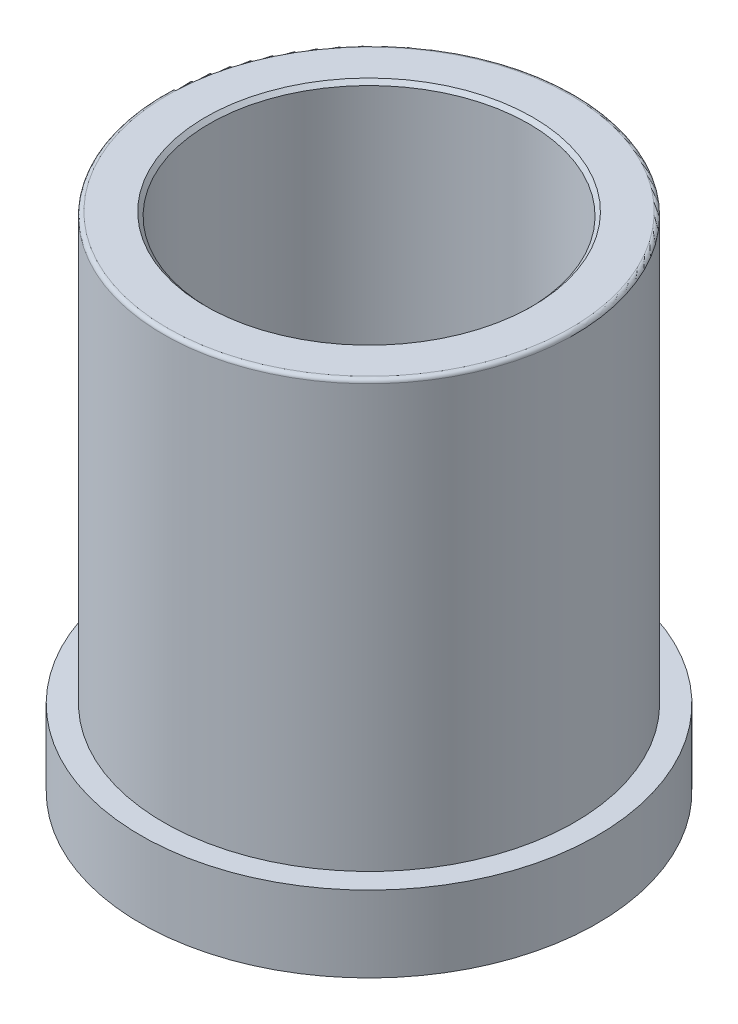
ISO-10303-21;
HEADER;
FILE_DESCRIPTION(('STEP AP214'),'2;1');
FILE_NAME('part.step','',(''),(''),'','','');
FILE_SCHEMA(('AUTOMOTIVE_DESIGN { 1 0 10303 214 1 1 1 1 }'));
ENDSEC;
DATA;
#1=APPLICATION_CONTEXT('core data for automotive mechanical design processes');
#2=APPLICATION_PROTOCOL_DEFINITION('international standard','automotive_design',2000,#1);
#3=PRODUCT_CONTEXT('',#1,'mechanical');
#4=PRODUCT('Part','Part','',(#3));
#5=PRODUCT_RELATED_PRODUCT_CATEGORY('part','',(#4));
#6=PRODUCT_DEFINITION_FORMATION('','',#4);
#7=PRODUCT_DEFINITION_CONTEXT('part definition',#1,'design');
#8=PRODUCT_DEFINITION('design','',#6,#7);
#9=PRODUCT_DEFINITION_SHAPE('','',#8);
#10=(LENGTH_UNIT() NAMED_UNIT(*) SI_UNIT(.MILLI.,.METRE.));
#11=(NAMED_UNIT(*) PLANE_ANGLE_UNIT() SI_UNIT($,.RADIAN.));
#12=(NAMED_UNIT(*) SI_UNIT($,.STERADIAN.) SOLID_ANGLE_UNIT());
#13=UNCERTAINTY_MEASURE_WITH_UNIT(LENGTH_MEASURE(1.E-05),#10,'distance_accuracy_value','');
#14=(GEOMETRIC_REPRESENTATION_CONTEXT(3) GLOBAL_UNCERTAINTY_ASSIGNED_CONTEXT((#13)) GLOBAL_UNIT_ASSIGNED_CONTEXT((#10,
#11,#12)) REPRESENTATION_CONTEXT('',''));
#15=CARTESIAN_POINT('',(0.,0.,0.));
#16=DIRECTION('',(0.,0.,1.));
#17=DIRECTION('',(1.,0.,0.));
#18=AXIS2_PLACEMENT_3D('',#15,#16,#17);
#19=CARTESIAN_POINT('',(0.,0.,0.));
#20=DIRECTION('',(0.,-1.,0.));
#21=DIRECTION('',(0.,0.,-1.));
#22=AXIS2_PLACEMENT_3D('',#19,#20,#21);
#23=CYLINDRICAL_SURFACE('',#22,27.);
#24=CARTESIAN_POINT('',(0.,55.5,0.));
#25=DIRECTION('',(0.,-1.,0.));
#26=DIRECTION('',(0.,0.,-1.));
#27=AXIS2_PLACEMENT_3D('',#24,#25,#26);
#28=CIRCLE('',#27,27.);
#29=CARTESIAN_POINT('',(0.,55.5,-27.));
#30=VERTEX_POINT('',#29);
#31=EDGE_CURVE('E21',#30,#30,#28,.T.);
#32=ORIENTED_EDGE('',*,*,#31,.T.);
#33=EDGE_LOOP('',(#32));
#34=FACE_BOUND('',#33,.T.);
#35=CARTESIAN_POINT('',(0.,0.,0.));
#36=DIRECTION('',(0.,-1.,0.));
#37=DIRECTION('',(0.,0.,-1.));
#38=AXIS2_PLACEMENT_3D('',#35,#36,#37);
#39=CIRCLE('',#38,27.);
#40=CARTESIAN_POINT('',(0.,0.,-27.));
#41=VERTEX_POINT('',#40);
#42=EDGE_CURVE('E49',#41,#41,#39,.T.);
#43=ORIENTED_EDGE('',*,*,#42,.F.);
#44=EDGE_LOOP('',(#43));
#45=FACE_BOUND('',#44,.T.);
#46=ADVANCED_FACE('F14',(#34,#45),#23,.T.);
#47=CARTESIAN_POINT('',(-27.,56.,0.));
#48=DIRECTION('',(0.,-1.,0.));
#49=DIRECTION('',(0.,0.,-1.));
#50=AXIS2_PLACEMENT_3D('',#47,#48,#49);
#51=PLANE('',#50);
#52=CARTESIAN_POINT('',(0.,56.,0.));
#53=DIRECTION('',(0.,-1.,0.));
#54=DIRECTION('',(0.,0.,-1.));
#55=AXIS2_PLACEMENT_3D('',#52,#53,#54);
#56=CIRCLE('',#55,26.5);
#57=CARTESIAN_POINT('',(0.,56.,-26.5));
#58=VERTEX_POINT('',#57);
#59=EDGE_CURVE('E9',#58,#58,#56,.F.);
#60=ORIENTED_EDGE('',*,*,#59,.T.);
#61=EDGE_LOOP('',(#60));
#62=FACE_BOUND('',#61,.T.);
#63=CARTESIAN_POINT('',(0.,56.,0.));
#64=DIRECTION('',(0.,-1.,0.));
#65=DIRECTION('',(0.,0.,-1.));
#66=AXIS2_PLACEMENT_3D('',#63,#64,#65);
#67=CIRCLE('',#66,21.5);
#68=CARTESIAN_POINT('',(0.,56.,-21.5));
#69=VERTEX_POINT('',#68);
#70=EDGE_CURVE('E37',#69,#69,#67,.T.);
#71=ORIENTED_EDGE('',*,*,#70,.T.);
#72=EDGE_LOOP('',(#71));
#73=FACE_BOUND('',#72,.T.);
#74=ADVANCED_FACE('F56',(#62,#73),#51,.F.);
#75=CARTESIAN_POINT('',(0.,0.,0.));
#76=DIRECTION('',(0.,-1.,0.));
#77=DIRECTION('',(0.,0.,-1.));
#78=AXIS2_PLACEMENT_3D('',#75,#76,#77);
#79=CYLINDRICAL_SURFACE('',#78,21.);
#80=CARTESIAN_POINT('',(0.,55.5,0.));
#81=DIRECTION('',(0.,-1.,0.));
#82=DIRECTION('',(0.,0.,-1.));
#83=AXIS2_PLACEMENT_3D('',#80,#81,#82);
#84=CIRCLE('',#83,21.);
#85=CARTESIAN_POINT('',(0.,55.5,-21.));
#86=VERTEX_POINT('',#85);
#87=EDGE_CURVE('E34',#86,#86,#84,.F.);
#88=ORIENTED_EDGE('',*,*,#87,.T.);
#89=EDGE_LOOP('',(#88));
#90=FACE_BOUND('',#89,.T.);
#91=CARTESIAN_POINT('',(0.,-10.,0.));
#92=DIRECTION('',(0.,-1.,0.));
#93=DIRECTION('',(0.,0.,-1.));
#94=AXIS2_PLACEMENT_3D('',#91,#92,#93);
#95=CIRCLE('',#94,21.);
#96=CARTESIAN_POINT('',(0.,-10.,-21.));
#97=VERTEX_POINT('',#96);
#98=EDGE_CURVE('E40',#97,#97,#95,.T.);
#99=ORIENTED_EDGE('',*,*,#98,.T.);
#100=EDGE_LOOP('',(#99));
#101=FACE_BOUND('',#100,.T.);
#102=ADVANCED_FACE('F63',(#90,#101),#79,.F.);
#103=CARTESIAN_POINT('',(0.,-10.15,0.));
#104=DIRECTION('',(0.,-1.,0.));
#105=DIRECTION('',(0.,0.,-1.));
#106=AXIS2_PLACEMENT_3D('',#103,#104,#105);
#107=CONICAL_SURFACE('',#106,21.1,0.588002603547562);
#108=CARTESIAN_POINT('',(0.,-10.36,0.));
#109=DIRECTION('',(0.,1.,0.));
#110=DIRECTION('',(0.,0.,1.));
#111=AXIS2_PLACEMENT_3D('',#108,#109,#110);
#112=CIRCLE('',#111,21.24);
#113=CARTESIAN_POINT('',(0.,-10.36,21.24));
#114=VERTEX_POINT('',#113);
#115=EDGE_CURVE('E25',#114,#114,#112,.F.);
#116=ORIENTED_EDGE('',*,*,#115,.T.);
#117=EDGE_LOOP('',(#116));
#118=FACE_BOUND('',#117,.T.);
#119=ORIENTED_EDGE('',*,*,#98,.F.);
#120=EDGE_LOOP('',(#119));
#121=FACE_BOUND('',#120,.T.);
#122=ADVANCED_FACE('F82',(#118,#121),#107,.F.);
#123=CARTESIAN_POINT('',(-21.1,-10.,0.));
#124=DIRECTION('',(0.,1.,0.));
#125=DIRECTION('',(0.,0.,1.));
#126=AXIS2_PLACEMENT_3D('',#123,#124,#125);
#127=PLANE('',#126);
#128=CARTESIAN_POINT('',(0.,-10.,0.));
#129=DIRECTION('',(0.,1.,0.));
#130=DIRECTION('',(0.,0.,1.));
#131=AXIS2_PLACEMENT_3D('',#128,#129,#130);
#132=CIRCLE('',#131,21.6);
#133=CARTESIAN_POINT('',(0.,-10.,21.6));
#134=VERTEX_POINT('',#133);
#135=EDGE_CURVE('E29',#134,#134,#132,.T.);
#136=ORIENTED_EDGE('',*,*,#135,.T.);
#137=EDGE_LOOP('',(#136));
#138=FACE_BOUND('',#137,.T.);
#139=CARTESIAN_POINT('',(0.,-10.,0.));
#140=DIRECTION('',(0.,-1.,0.));
#141=DIRECTION('',(0.,0.,-1.));
#142=AXIS2_PLACEMENT_3D('',#139,#140,#141);
#143=CIRCLE('',#142,30.);
#144=CARTESIAN_POINT('',(0.,-10.,-30.));
#145=VERTEX_POINT('',#144);
#146=EDGE_CURVE('E43',#145,#145,#143,.T.);
#147=ORIENTED_EDGE('',*,*,#146,.T.);
#148=EDGE_LOOP('',(#147));
#149=FACE_BOUND('',#148,.T.);
#150=ADVANCED_FACE('F85',(#138,#149),#127,.F.);
#151=CARTESIAN_POINT('',(0.,0.,0.));
#152=DIRECTION('',(0.,-1.,0.));
#153=DIRECTION('',(0.,0.,-1.));
#154=AXIS2_PLACEMENT_3D('',#151,#152,#153);
#155=CYLINDRICAL_SURFACE('',#154,30.);
#156=ORIENTED_EDGE('',*,*,#146,.F.);
#157=EDGE_LOOP('',(#156));
#158=FACE_BOUND('',#157,.T.);
#159=CARTESIAN_POINT('',(0.,0.,0.));
#160=DIRECTION('',(0.,-1.,0.));
#161=DIRECTION('',(0.,0.,-1.));
#162=AXIS2_PLACEMENT_3D('',#159,#160,#161);
#163=CIRCLE('',#162,30.);
#164=CARTESIAN_POINT('',(0.,0.,-30.));
#165=VERTEX_POINT('',#164);
#166=EDGE_CURVE('E46',#165,#165,#163,.T.);
#167=ORIENTED_EDGE('',*,*,#166,.T.);
#168=EDGE_LOOP('',(#167));
#169=FACE_BOUND('',#168,.T.);
#170=ADVANCED_FACE('F97',(#158,#169),#155,.T.);
#171=CARTESIAN_POINT('',(-30.,0.,0.));
#172=DIRECTION('',(0.,-1.,0.));
#173=DIRECTION('',(0.,0.,-1.));
#174=AXIS2_PLACEMENT_3D('',#171,#172,#173);
#175=PLANE('',#174);
#176=ORIENTED_EDGE('',*,*,#166,.F.);
#177=EDGE_LOOP('',(#176));
#178=FACE_BOUND('',#177,.T.);
#179=ORIENTED_EDGE('',*,*,#42,.T.);
#180=EDGE_LOOP('',(#179));
#181=FACE_BOUND('',#180,.T.);
#182=ADVANCED_FACE('F53',(#178,#181),#175,.F.);
#183=CARTESIAN_POINT('',(0.,56.,0.));
#184=DIRECTION('',(0.,1.,0.));
#185=DIRECTION('',(0.,0.,1.));
#186=AXIS2_PLACEMENT_3D('',#183,#184,#185);
#187=CONICAL_SURFACE('',#186,21.5,0.785398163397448);
#188=ORIENTED_EDGE('',*,*,#87,.F.);
#189=EDGE_LOOP('',(#188));
#190=FACE_BOUND('',#189,.T.);
#191=ORIENTED_EDGE('',*,*,#70,.F.);
#192=EDGE_LOOP('',(#191));
#193=FACE_BOUND('',#192,.T.);
#194=ADVANCED_FACE('F67',(#190,#193),#187,.F.);
#195=CARTESIAN_POINT('',(0.,-10.5,0.));
#196=DIRECTION('',(0.,1.,0.));
#197=DIRECTION('',(0.,0.,1.));
#198=AXIS2_PLACEMENT_3D('',#195,#196,#197);
#199=CONICAL_SURFACE('',#198,21.1,0.785398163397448);
#200=ORIENTED_EDGE('',*,*,#135,.F.);
#201=EDGE_LOOP('',(#200));
#202=FACE_BOUND('',#201,.T.);
#203=ORIENTED_EDGE('',*,*,#115,.F.);
#204=EDGE_LOOP('',(#203));
#205=FACE_BOUND('',#204,.T.);
#206=ADVANCED_FACE('F69',(#202,#205),#199,.T.);
#207=CARTESIAN_POINT('',(0.,55.5,0.));
#208=DIRECTION('',(0.,-1.,0.));
#209=DIRECTION('',(0.,0.,-1.));
#210=AXIS2_PLACEMENT_3D('',#207,#208,#209);
#211=TOROIDAL_SURFACE('',#210,26.5,0.5);
#212=ORIENTED_EDGE('',*,*,#59,.F.);
#213=EDGE_LOOP('',(#212));
#214=FACE_BOUND('',#213,.T.);
#215=ORIENTED_EDGE('',*,*,#31,.F.);
#216=EDGE_LOOP('',(#215));
#217=FACE_BOUND('',#216,.T.);
#218=ADVANCED_FACE('F16',(#214,#217),#211,.T.);
#219=CLOSED_SHELL('',(#46,#74,#102,#122,#150,#170,#182,#194,#206,#218));
#220=MANIFOLD_SOLID_BREP('B1',#219);
#221=ADVANCED_BREP_SHAPE_REPRESENTATION('',(#18,#220),#14);
#222=SHAPE_DEFINITION_REPRESENTATION(#9,#221);
ENDSEC;
END-ISO-10303-21;
